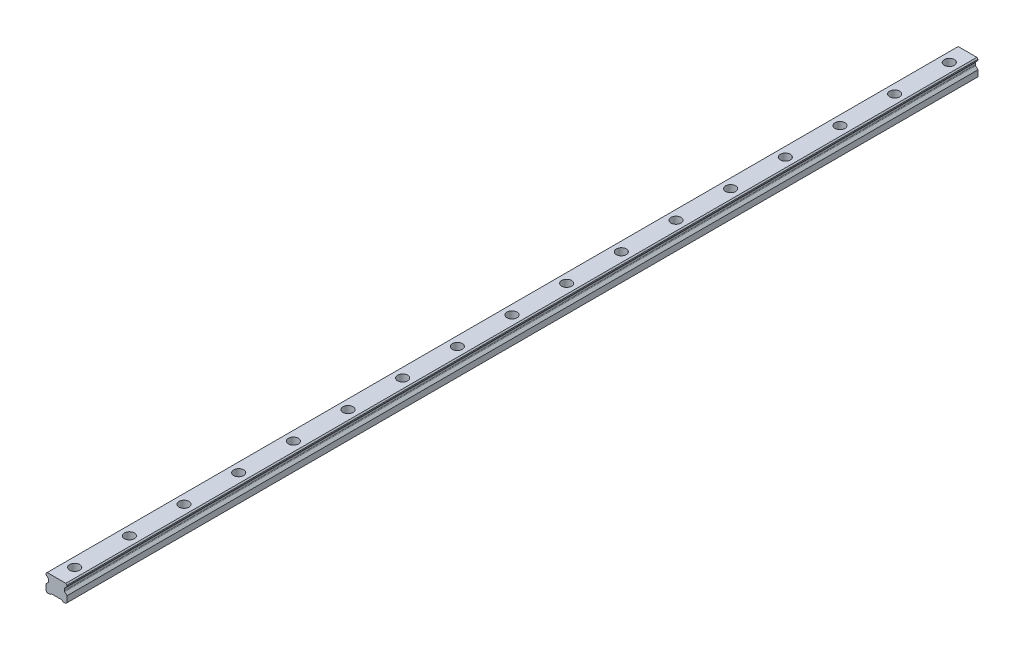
from build123d import *

# Parameters (mm, degrees)
SKETCH1_W           = 23
SKETCH1_H           = 19.2
BOSS_EXTRUDE1_DEPTH = 500
CUT_EXTRUDE1_DEPTH  = 1001.250413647
CHAMFER1_SIZE       = 1.25
FILLET1_R           = 1.25
CUT_EXTRUDE2_DEPTH  = 1001.250413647
SKETCH4_R           = 5.5
SKETCH4_R_2         = 3.5
CUT_EXTRUDE3_DEPTH  = 9
SKETCH4_2_R         = 3.5
CUT_EXTRUDE4_DEPTH  = 501.50063936
LPATTERN1_COUNT     = 17
LPATTERN1_PITCH     = 60


with BuildPart() as part:
    # Sketch1 → Boss-Extrude1 (new, symmetric)
    with BuildSketch(Plane.XY):
        with Locations((0, 9.6)):
            Rectangle(SKETCH1_W, SKETCH1_H)
    extrude(amount=BOSS_EXTRUDE1_DEPTH, both=True)

    # Sketch2 → Cut-Extrude1 (cut, through all)
    with BuildSketch(Plane.XY.offset(500)):
        Polygon((-11.5, 16.7), (-11.5, 7.95), (-8.583333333, 10.866666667), (-8.583333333, 13.783333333), align=None)
        Polygon((8.583333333, 13.783333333), (11.5, 16.7), (11.5, 7.95), (8.583333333, 10.866666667), align=None)
    extrude(amount=-CUT_EXTRUDE1_DEPTH, mode=Mode.SUBTRACT)

    # Chamfer1
    chamfer1_edges = [part.edges().sort_by_distance(p)[0] for p in [
        (-11.5, 19.2, 0),
        (11.5, 19.2, 0),
        (11.5, 0, 0),
        (-11.5, 0, 0),
    ]]
    chamfer(chamfer1_edges, length=CHAMFER1_SIZE)

    # Fillet1
    fillet1_edges = [part.edges().sort_by_distance(p)[0] for p in [
        (-8.583333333, 13.783333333, 0),
        (-8.583333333, 10.866666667, 0),
        (8.583333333, 10.866666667, 0),
        (8.583333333, 13.783333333, 0),
    ]]
    fillet(fillet1_edges, radius=FILLET1_R)

    # Sketch3 → Cut-Extrude2 (cut, through all)
    with BuildSketch(Plane.XY.offset(500)):
        Polygon((-7, 0), (-5.75, 1.25), (5.75, 1.25), (7, 0), align=None)
    extrude(amount=-CUT_EXTRUDE2_DEPTH, mode=Mode.SUBTRACT)

    # Sketch4 → Cut-Extrude3 (cut)
    with BuildSketch(Plane(origin=(0, 19.2, 0), x_dir=(1, 0, 0), z_dir=(0, 1, 0))):
        with Locations(Location((0, -480, 0), (0, 0, 270))):
            Circle(SKETCH4_R)
        with Locations(Location((0, -480, 0), (0, 0, 270))):
            Circle(SKETCH4_R_2, mode=Mode.SUBTRACT)
    cut_extrude3 = extrude(amount=-CUT_EXTRUDE3_DEPTH, mode=Mode.SUBTRACT)

    # Sketch4_2 → Cut-Extrude4 (cut, through all)
    with BuildSketch(Plane(origin=(0, 19.2, 0), x_dir=(1, 0, 0), z_dir=(0, 1, 0))):
        with Locations(Location((0, -480, 0), (0, 0, 270))):
            Circle(SKETCH4_2_R)
    cut_extrude4 = extrude(amount=-CUT_EXTRUDE4_DEPTH, mode=Mode.SUBTRACT)

    # LPattern1: Cut-Extrude3, Cut-Extrude4 ×17
    with Locations(*[(0, 0, -i * LPATTERN1_PITCH) for i in range(1, LPATTERN1_COUNT)]):
        add(cut_extrude3, mode=Mode.SUBTRACT)
        add(cut_extrude4, mode=Mode.SUBTRACT)


solid = part.part
